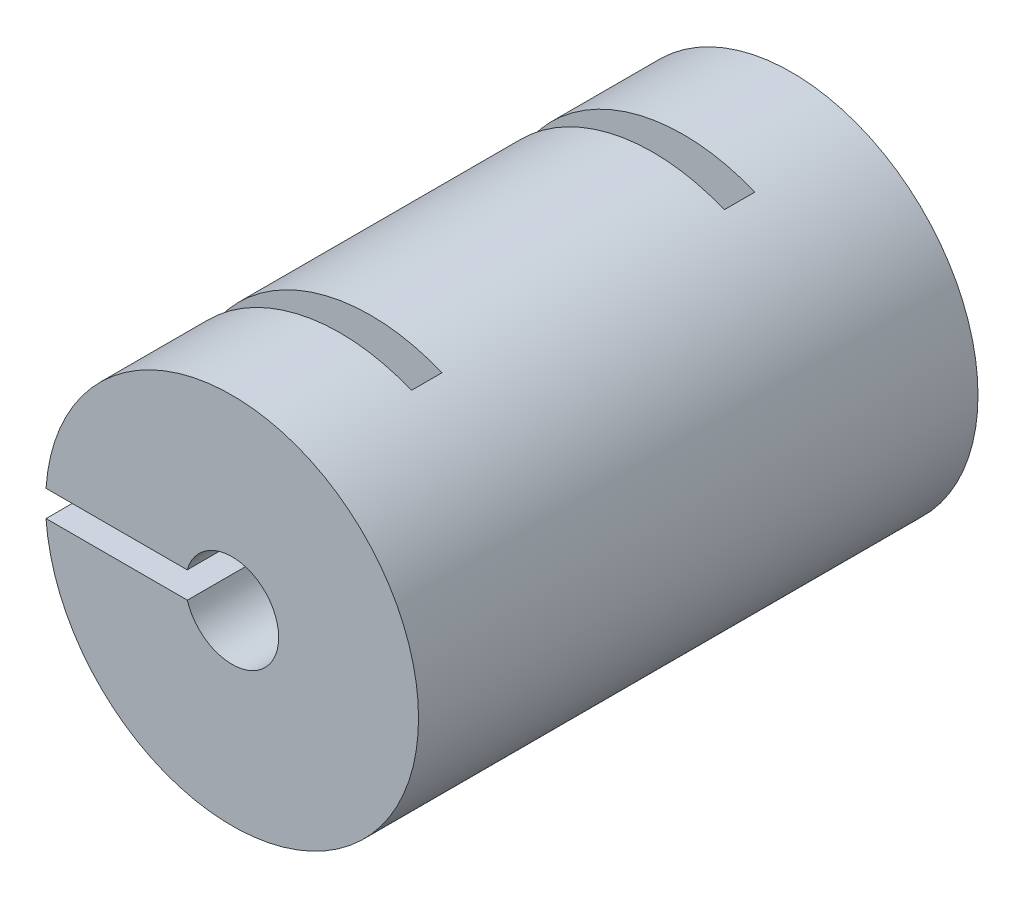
ISO-10303-21;
HEADER;
FILE_DESCRIPTION(('STEP AP214'),'2;1');
FILE_NAME('part.step','',(''),(''),'','','');
FILE_SCHEMA(('AUTOMOTIVE_DESIGN { 1 0 10303 214 1 1 1 1 }'));
ENDSEC;
DATA;
#1=APPLICATION_CONTEXT('core data for automotive mechanical design processes');
#2=APPLICATION_PROTOCOL_DEFINITION('international standard','automotive_design',2000,#1);
#3=PRODUCT_CONTEXT('',#1,'mechanical');
#4=PRODUCT('Part','Part','',(#3));
#5=PRODUCT_RELATED_PRODUCT_CATEGORY('part','',(#4));
#6=PRODUCT_DEFINITION_FORMATION('','',#4);
#7=PRODUCT_DEFINITION_CONTEXT('part definition',#1,'design');
#8=PRODUCT_DEFINITION('design','',#6,#7);
#9=PRODUCT_DEFINITION_SHAPE('','',#8);
#10=(LENGTH_UNIT() NAMED_UNIT(*) SI_UNIT(.MILLI.,.METRE.));
#11=(NAMED_UNIT(*) PLANE_ANGLE_UNIT() SI_UNIT($,.RADIAN.));
#12=(NAMED_UNIT(*) SI_UNIT($,.STERADIAN.) SOLID_ANGLE_UNIT());
#13=UNCERTAINTY_MEASURE_WITH_UNIT(LENGTH_MEASURE(1.E-05),#10,'distance_accuracy_value','');
#14=(GEOMETRIC_REPRESENTATION_CONTEXT(3) GLOBAL_UNCERTAINTY_ASSIGNED_CONTEXT((#13)) GLOBAL_UNIT_ASSIGNED_CONTEXT((#10,
#11,#12)) REPRESENTATION_CONTEXT('',''));
#15=CARTESIAN_POINT('',(0.,0.,0.));
#16=DIRECTION('',(0.,0.,1.));
#17=DIRECTION('',(1.,0.,0.));
#18=AXIS2_PLACEMENT_3D('',#15,#16,#17);
#19=CARTESIAN_POINT('',(0.,0.,9.525));
#20=DIRECTION('',(0.,0.,-1.));
#21=DIRECTION('',(-1.,0.,0.));
#22=AXIS2_PLACEMENT_3D('',#19,#20,#21);
#23=CYLINDRICAL_SURFACE('',#22,1.5875);
#24=DIRECTION('',(0.,0.,-1.));
#25=VECTOR('',#24,1.);
#26=CARTESIAN_POINT('',(-1.52101463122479,-0.454610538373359,9.525));
#27=LINE('',#26,#25);
#28=CARTESIAN_POINT('',(-1.52101463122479,-0.454610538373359,-9.525));
#29=VERTEX_POINT('',#28);
#30=CARTESIAN_POINT('',(-1.52101463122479,-0.454610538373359,-5.84564938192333));
#31=VERTEX_POINT('',#30);
#32=EDGE_CURVE('E214',#29,#31,#27,.F.);
#33=ORIENTED_EDGE('',*,*,#32,.T.);
#34=CARTESIAN_POINT('',(0.,0.,-5.84564938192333));
#35=DIRECTION('',(0.,0.,1.));
#36=DIRECTION('',(1.,0.,0.));
#37=AXIS2_PLACEMENT_3D('',#34,#35,#36);
#38=CIRCLE('',#37,1.5875);
#39=CARTESIAN_POINT('',(-1.52633171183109,0.436426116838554,-5.84564938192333));
#40=VERTEX_POINT('',#39);
#41=EDGE_CURVE('E192',#31,#40,#38,.T.);
#42=ORIENTED_EDGE('',*,*,#41,.T.);
#43=DIRECTION('',(0.,0.,-1.));
#44=VECTOR('',#43,1.);
#45=CARTESIAN_POINT('',(-1.52633171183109,0.436426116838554,9.525));
#46=LINE('',#45,#44);
#47=CARTESIAN_POINT('',(-1.52633171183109,0.436426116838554,-9.525));
#48=VERTEX_POINT('',#47);
#49=EDGE_CURVE('E217',#40,#48,#46,.T.);
#50=ORIENTED_EDGE('',*,*,#49,.T.);
#51=CARTESIAN_POINT('',(0.,0.,-9.525));
#52=DIRECTION('',(0.,0.,1.));
#53=DIRECTION('',(1.,0.,0.));
#54=AXIS2_PLACEMENT_3D('',#51,#52,#53);
#55=CIRCLE('',#54,1.5875);
#56=EDGE_CURVE('E265',#29,#48,#55,.T.);
#57=ORIENTED_EDGE('',*,*,#56,.F.);
#58=EDGE_LOOP('',(#33,#42,#50,#57));
#59=FACE_BOUND('',#58,.T.);
#60=ADVANCED_FACE('F29',(#59),#23,.F.);
#61=CARTESIAN_POINT('',(0.,0.,4.80687655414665));
#62=DIRECTION('',(0.,0.,-1.));
#63=DIRECTION('',(-1.,0.,0.));
#64=AXIS2_PLACEMENT_3D('',#61,#62,#63);
#65=CIRCLE('',#64,1.5875);
#66=CARTESIAN_POINT('',(-1.52633171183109,0.436426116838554,4.80687655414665));
#67=VERTEX_POINT('',#66);
#68=CARTESIAN_POINT('',(-1.52101463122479,-0.454610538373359,4.80687655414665));
#69=VERTEX_POINT('',#68);
#70=EDGE_CURVE('E232',#67,#69,#65,.T.);
#71=ORIENTED_EDGE('',*,*,#70,.F.);
#72=DIRECTION('',(0.,0.,-1.));
#73=VECTOR('',#72,1.);
#74=CARTESIAN_POINT('',(-1.52633171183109,0.436426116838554,9.525));
#75=LINE('',#74,#73);
#76=CARTESIAN_POINT('',(-1.52633171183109,0.436426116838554,4.445));
#77=VERTEX_POINT('',#76);
#78=EDGE_CURVE('E280',#77,#67,#75,.F.);
#79=ORIENTED_EDGE('',*,*,#78,.F.);
#80=CARTESIAN_POINT('',(0.,0.,4.445));
#81=DIRECTION('',(0.,0.,-1.));
#82=DIRECTION('',(-1.,0.,0.));
#83=AXIS2_PLACEMENT_3D('',#80,#81,#82);
#84=CIRCLE('',#83,1.5875);
#85=CARTESIAN_POINT('',(-1.52101463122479,-0.454610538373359,4.445));
#86=VERTEX_POINT('',#85);
#87=EDGE_CURVE('E277',#86,#77,#84,.T.);
#88=ORIENTED_EDGE('',*,*,#87,.F.);
#89=DIRECTION('',(0.,0.,-1.));
#90=VECTOR('',#89,1.);
#91=CARTESIAN_POINT('',(-1.52101463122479,-0.454610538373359,9.525));
#92=LINE('',#91,#90);
#93=EDGE_CURVE('E283',#69,#86,#92,.T.);
#94=ORIENTED_EDGE('',*,*,#93,.F.);
#95=EDGE_LOOP('',(#71,#79,#88,#94));
#96=FACE_BOUND('',#95,.T.);
#97=CARTESIAN_POINT('',(-1.52633171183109,0.436426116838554,-4.445));
#98=VERTEX_POINT('',#97);
#99=CARTESIAN_POINT('',(-1.52633171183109,0.436426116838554,-4.80687655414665));
#100=VERTEX_POINT('',#99);
#101=EDGE_CURVE('E218',#98,#100,#46,.T.);
#102=ORIENTED_EDGE('',*,*,#101,.T.);
#103=CARTESIAN_POINT('',(0.,0.,-4.80687655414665));
#104=DIRECTION('',(0.,0.,-1.));
#105=DIRECTION('',(-1.,0.,0.));
#106=AXIS2_PLACEMENT_3D('',#103,#104,#105);
#107=CIRCLE('',#106,1.5875);
#108=CARTESIAN_POINT('',(-1.52101463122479,-0.454610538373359,-4.80687655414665));
#109=VERTEX_POINT('',#108);
#110=EDGE_CURVE('E168',#100,#109,#107,.T.);
#111=ORIENTED_EDGE('',*,*,#110,.T.);
#112=CARTESIAN_POINT('',(-1.52101463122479,-0.454610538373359,-4.445));
#113=VERTEX_POINT('',#112);
#114=EDGE_CURVE('E213',#109,#113,#27,.F.);
#115=ORIENTED_EDGE('',*,*,#114,.T.);
#116=CARTESIAN_POINT('',(0.,0.,-4.445));
#117=DIRECTION('',(0.,0.,1.));
#118=DIRECTION('',(1.,0.,0.));
#119=AXIS2_PLACEMENT_3D('',#116,#117,#118);
#120=CIRCLE('',#119,1.5875);
#121=EDGE_CURVE('E210',#98,#113,#120,.T.);
#122=ORIENTED_EDGE('',*,*,#121,.F.);
#123=EDGE_LOOP('',(#102,#111,#115,#122));
#124=FACE_BOUND('',#123,.T.);
#125=ADVANCED_FACE('F335',(#96,#124),#23,.F.);
#126=CARTESIAN_POINT('',(0.,0.,9.525));
#127=DIRECTION('',(0.,0.,-1.));
#128=DIRECTION('',(-1.,0.,0.));
#129=AXIS2_PLACEMENT_3D('',#126,#127,#128);
#130=CYLINDRICAL_SURFACE('',#129,6.35);
#131=CARTESIAN_POINT('',(0.,0.,4.80687655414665));
#132=DIRECTION('',(0.,0.,-1.));
#133=DIRECTION('',(-1.,0.,0.));
#134=AXIS2_PLACEMENT_3D('',#131,#132,#133);
#135=CIRCLE('',#134,6.35);
#136=CARTESIAN_POINT('',(-6.33498478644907,0.436426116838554,4.80687655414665));
#137=VERTEX_POINT('',#136);
#138=CARTESIAN_POINT('',(2.42900531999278,5.86706341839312,4.80687655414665));
#139=VERTEX_POINT('',#138);
#140=EDGE_CURVE('E237',#137,#139,#135,.T.);
#141=ORIENTED_EDGE('',*,*,#140,.T.);
#142=DIRECTION('',(0.,0.,-1.));
#143=VECTOR('',#142,1.);
#144=CARTESIAN_POINT('',(2.42900531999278,5.86706341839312,9.525));
#145=LINE('',#144,#143);
#146=CARTESIAN_POINT('',(2.42900531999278,5.86706341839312,5.84564938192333));
#147=VERTEX_POINT('',#146);
#148=EDGE_CURVE('E296',#139,#147,#145,.F.);
#149=ORIENTED_EDGE('',*,*,#148,.T.);
#150=CARTESIAN_POINT('',(0.,0.,5.84564938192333));
#151=DIRECTION('',(0.,0.,1.));
#152=DIRECTION('',(1.,0.,0.));
#153=AXIS2_PLACEMENT_3D('',#150,#151,#152);
#154=CIRCLE('',#153,6.35);
#155=CARTESIAN_POINT('',(-6.33498478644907,0.436426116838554,5.84564938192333));
#156=VERTEX_POINT('',#155);
#157=EDGE_CURVE('E229',#147,#156,#154,.T.);
#158=ORIENTED_EDGE('',*,*,#157,.T.);
#159=DIRECTION('',(0.,0.,-1.));
#160=VECTOR('',#159,1.);
#161=CARTESIAN_POINT('',(-6.33498478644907,0.436426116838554,9.525));
#162=LINE('',#161,#160);
#163=CARTESIAN_POINT('',(-6.33498478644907,0.436426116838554,9.525));
#164=VERTEX_POINT('',#163);
#165=EDGE_CURVE('E257',#156,#164,#162,.F.);
#166=ORIENTED_EDGE('',*,*,#165,.T.);
#167=CARTESIAN_POINT('',(0.,0.,9.525));
#168=DIRECTION('',(0.,0.,1.));
#169=DIRECTION('',(1.,0.,0.));
#170=AXIS2_PLACEMENT_3D('',#167,#168,#169);
#171=CIRCLE('',#170,6.35);
#172=CARTESIAN_POINT('',(-6.33370580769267,-0.454610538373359,9.525));
#173=VERTEX_POINT('',#172);
#174=EDGE_CURVE('E274',#173,#164,#171,.T.);
#175=ORIENTED_EDGE('',*,*,#174,.F.);
#176=DIRECTION('',(0.,0.,-1.));
#177=VECTOR('',#176,1.);
#178=CARTESIAN_POINT('',(-6.33370580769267,-0.454610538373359,9.525));
#179=LINE('',#178,#177);
#180=CARTESIAN_POINT('',(-6.33370580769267,-0.454610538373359,5.84564938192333));
#181=VERTEX_POINT('',#180);
#182=EDGE_CURVE('E262',#173,#181,#179,.T.);
#183=ORIENTED_EDGE('',*,*,#182,.T.);
#184=CARTESIAN_POINT('',(2.42900531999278,-5.86706341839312,5.84564938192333));
#185=VERTEX_POINT('',#184);
#186=EDGE_CURVE('E230',#181,#185,#154,.T.);
#187=ORIENTED_EDGE('',*,*,#186,.T.);
#188=DIRECTION('',(0.,0.,-1.));
#189=VECTOR('',#188,1.);
#190=CARTESIAN_POINT('',(2.42900531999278,-5.86706341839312,9.525));
#191=LINE('',#190,#189);
#192=CARTESIAN_POINT('',(2.42900531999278,-5.86706341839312,4.80687655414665));
#193=VERTEX_POINT('',#192);
#194=EDGE_CURVE('E293',#185,#193,#191,.T.);
#195=ORIENTED_EDGE('',*,*,#194,.T.);
#196=CARTESIAN_POINT('',(-6.33370580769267,-0.454610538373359,4.80687655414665));
#197=VERTEX_POINT('',#196);
#198=EDGE_CURVE('E240',#193,#197,#135,.T.);
#199=ORIENTED_EDGE('',*,*,#198,.T.);
#200=CARTESIAN_POINT('',(-6.33370580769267,-0.454610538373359,4.445));
#201=VERTEX_POINT('',#200);
#202=EDGE_CURVE('E261',#197,#201,#179,.T.);
#203=ORIENTED_EDGE('',*,*,#202,.T.);
#204=CARTESIAN_POINT('',(0.,0.,4.445));
#205=DIRECTION('',(0.,0.,-1.));
#206=DIRECTION('',(-1.,0.,0.));
#207=AXIS2_PLACEMENT_3D('',#204,#205,#206);
#208=CIRCLE('',#207,6.35);
#209=CARTESIAN_POINT('',(-6.33498478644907,0.436426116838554,4.445));
#210=VERTEX_POINT('',#209);
#211=EDGE_CURVE('E254',#201,#210,#208,.T.);
#212=ORIENTED_EDGE('',*,*,#211,.T.);
#213=EDGE_CURVE('E258',#210,#137,#162,.F.);
#214=ORIENTED_EDGE('',*,*,#213,.T.);
#215=EDGE_LOOP('',(#141,#149,#158,#166,#175,#183,#187,#195,#199,#203,#212,#214));
#216=FACE_BOUND('',#215,.T.);
#217=CARTESIAN_POINT('',(0.,0.,-5.84564938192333));
#218=DIRECTION('',(0.,0.,1.));
#219=DIRECTION('',(1.,0.,0.));
#220=AXIS2_PLACEMENT_3D('',#217,#218,#219);
#221=CIRCLE('',#220,6.35);
#222=CARTESIAN_POINT('',(-6.33370580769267,-0.454610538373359,-5.84564938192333));
#223=VERTEX_POINT('',#222);
#224=CARTESIAN_POINT('',(2.42900531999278,-5.86706341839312,-5.84564938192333));
#225=VERTEX_POINT('',#224);
#226=EDGE_CURVE('E190',#223,#225,#221,.T.);
#227=ORIENTED_EDGE('',*,*,#226,.F.);
#228=DIRECTION('',(0.,0.,-1.));
#229=VECTOR('',#228,1.);
#230=CARTESIAN_POINT('',(-6.33370580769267,-0.454610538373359,9.525));
#231=LINE('',#230,#229);
#232=CARTESIAN_POINT('',(-6.33370580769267,-0.454610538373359,-9.525));
#233=VERTEX_POINT('',#232);
#234=EDGE_CURVE('E301',#233,#223,#231,.F.);
#235=ORIENTED_EDGE('',*,*,#234,.F.);
#236=CARTESIAN_POINT('',(0.,0.,-9.525));
#237=DIRECTION('',(0.,0.,1.));
#238=DIRECTION('',(1.,0.,0.));
#239=AXIS2_PLACEMENT_3D('',#236,#237,#238);
#240=CIRCLE('',#239,6.35);
#241=CARTESIAN_POINT('',(-6.33498478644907,0.436426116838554,-9.525));
#242=VERTEX_POINT('',#241);
#243=EDGE_CURVE('E271',#233,#242,#240,.T.);
#244=ORIENTED_EDGE('',*,*,#243,.T.);
#245=DIRECTION('',(0.,0.,-1.));
#246=VECTOR('',#245,1.);
#247=CARTESIAN_POINT('',(-6.33498478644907,0.436426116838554,9.525));
#248=LINE('',#247,#246);
#249=CARTESIAN_POINT('',(-6.33498478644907,0.436426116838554,-5.84564938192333));
#250=VERTEX_POINT('',#249);
#251=EDGE_CURVE('E304',#250,#242,#248,.T.);
#252=ORIENTED_EDGE('',*,*,#251,.F.);
#253=CARTESIAN_POINT('',(2.42900531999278,5.86706341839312,-5.84564938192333));
#254=VERTEX_POINT('',#253);
#255=EDGE_CURVE('E193',#254,#250,#221,.T.);
#256=ORIENTED_EDGE('',*,*,#255,.F.);
#257=DIRECTION('',(0.,0.,-1.));
#258=VECTOR('',#257,1.);
#259=CARTESIAN_POINT('',(2.42900531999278,5.86706341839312,9.525));
#260=LINE('',#259,#258);
#261=CARTESIAN_POINT('',(2.42900531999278,5.86706341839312,-4.80687655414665));
#262=VERTEX_POINT('',#261);
#263=EDGE_CURVE('E11',#262,#254,#260,.T.);
#264=ORIENTED_EDGE('',*,*,#263,.F.);
#265=CARTESIAN_POINT('',(0.,0.,-4.80687655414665));
#266=DIRECTION('',(0.,0.,-1.));
#267=DIRECTION('',(-1.,0.,0.));
#268=AXIS2_PLACEMENT_3D('',#265,#266,#267);
#269=CIRCLE('',#268,6.35);
#270=CARTESIAN_POINT('',(-6.33498478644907,0.436426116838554,-4.80687655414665));
#271=VERTEX_POINT('',#270);
#272=EDGE_CURVE('E171',#271,#262,#269,.T.);
#273=ORIENTED_EDGE('',*,*,#272,.F.);
#274=CARTESIAN_POINT('',(-6.33498478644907,0.436426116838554,-4.445));
#275=VERTEX_POINT('',#274);
#276=EDGE_CURVE('E305',#275,#271,#248,.T.);
#277=ORIENTED_EDGE('',*,*,#276,.F.);
#278=CARTESIAN_POINT('',(0.,0.,-4.445));
#279=DIRECTION('',(0.,0.,1.));
#280=DIRECTION('',(1.,0.,0.));
#281=AXIS2_PLACEMENT_3D('',#278,#279,#280);
#282=CIRCLE('',#281,6.35);
#283=CARTESIAN_POINT('',(-6.33370580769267,-0.454610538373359,-4.445));
#284=VERTEX_POINT('',#283);
#285=EDGE_CURVE('E299',#275,#284,#282,.T.);
#286=ORIENTED_EDGE('',*,*,#285,.T.);
#287=CARTESIAN_POINT('',(-6.33370580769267,-0.454610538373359,-4.80687655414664));
#288=VERTEX_POINT('',#287);
#289=EDGE_CURVE('E51',#288,#284,#231,.F.);
#290=ORIENTED_EDGE('',*,*,#289,.F.);
#291=CARTESIAN_POINT('',(2.42900531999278,-5.86706341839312,-4.80687655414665));
#292=VERTEX_POINT('',#291);
#293=EDGE_CURVE('E44',#292,#288,#269,.T.);
#294=ORIENTED_EDGE('',*,*,#293,.F.);
#295=DIRECTION('',(0.,0.,-1.));
#296=VECTOR('',#295,1.);
#297=CARTESIAN_POINT('',(2.42900531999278,-5.86706341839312,9.525));
#298=LINE('',#297,#296);
#299=EDGE_CURVE('E37',#225,#292,#298,.F.);
#300=ORIENTED_EDGE('',*,*,#299,.F.);
#301=EDGE_LOOP('',(#227,#235,#244,#252,#256,#264,#273,#277,#286,#290,#294,#300));
#302=FACE_BOUND('',#301,.T.);
#303=ADVANCED_FACE('F31',(#216,#302),#130,.T.);
#304=CARTESIAN_POINT('',(0.263674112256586,0.436426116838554,-4.445));
#305=DIRECTION('',(0.,-1.,0.));
#306=DIRECTION('',(0.,0.,-1.));
#307=AXIS2_PLACEMENT_3D('',#304,#305,#306);
#308=PLANE('',#307);
#309=ORIENTED_EDGE('',*,*,#49,.F.);
#310=DIRECTION('',(-1.,0.,0.));
#311=VECTOR('',#310,1.);
#312=CARTESIAN_POINT('',(0.263674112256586,0.436426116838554,-5.84564938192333));
#313=LINE('',#312,#311);
#314=EDGE_CURVE('E196',#40,#250,#313,.T.);
#315=ORIENTED_EDGE('',*,*,#314,.T.);
#316=ORIENTED_EDGE('',*,*,#251,.T.);
#317=DIRECTION('',(-1.,0.,0.));
#318=VECTOR('',#317,1.);
#319=CARTESIAN_POINT('',(0.263674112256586,0.436426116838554,-9.525));
#320=LINE('',#319,#318);
#321=EDGE_CURVE('E202',#48,#242,#320,.T.);
#322=ORIENTED_EDGE('',*,*,#321,.F.);
#323=EDGE_LOOP('',(#309,#315,#316,#322));
#324=FACE_BOUND('',#323,.T.);
#325=ADVANCED_FACE('F326',(#324),#308,.T.);
#326=ORIENTED_EDGE('',*,*,#276,.T.);
#327=DIRECTION('',(1.,0.,0.));
#328=VECTOR('',#327,1.);
#329=CARTESIAN_POINT('',(0.263674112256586,0.436426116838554,-4.80687655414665));
#330=LINE('',#329,#328);
#331=EDGE_CURVE('E187',#271,#100,#330,.T.);
#332=ORIENTED_EDGE('',*,*,#331,.T.);
#333=ORIENTED_EDGE('',*,*,#101,.F.);
#334=DIRECTION('',(-1.,0.,0.));
#335=VECTOR('',#334,1.);
#336=CARTESIAN_POINT('',(0.263674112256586,0.436426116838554,-4.445));
#337=LINE('',#336,#335);
#338=EDGE_CURVE('E207',#98,#275,#337,.T.);
#339=ORIENTED_EDGE('',*,*,#338,.T.);
#340=EDGE_LOOP('',(#326,#332,#333,#339));
#341=FACE_BOUND('',#340,.T.);
#342=ADVANCED_FACE('F328',(#341),#308,.T.);
#343=CARTESIAN_POINT('',(0.263674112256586,-0.454610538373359,-4.445));
#344=DIRECTION('',(0.,1.,0.));
#345=DIRECTION('',(0.,0.,1.));
#346=AXIS2_PLACEMENT_3D('',#343,#344,#345);
#347=PLANE('',#346);
#348=ORIENTED_EDGE('',*,*,#234,.T.);
#349=DIRECTION('',(1.,0.,0.));
#350=VECTOR('',#349,1.);
#351=CARTESIAN_POINT('',(0.263674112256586,-0.454610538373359,-5.84564938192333));
#352=LINE('',#351,#350);
#353=EDGE_CURVE('E179',#223,#31,#352,.T.);
#354=ORIENTED_EDGE('',*,*,#353,.T.);
#355=ORIENTED_EDGE('',*,*,#32,.F.);
#356=DIRECTION('',(1.,0.,0.));
#357=VECTOR('',#356,1.);
#358=CARTESIAN_POINT('',(0.263674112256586,-0.454610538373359,-9.525));
#359=LINE('',#358,#357);
#360=EDGE_CURVE('E199',#233,#29,#359,.T.);
#361=ORIENTED_EDGE('',*,*,#360,.F.);
#362=EDGE_LOOP('',(#348,#354,#355,#361));
#363=FACE_BOUND('',#362,.T.);
#364=ADVANCED_FACE('F312',(#363),#347,.T.);
#365=ORIENTED_EDGE('',*,*,#114,.F.);
#366=DIRECTION('',(-1.,0.,0.));
#367=VECTOR('',#366,1.);
#368=CARTESIAN_POINT('',(0.263674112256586,-0.454610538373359,-4.80687655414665));
#369=LINE('',#368,#367);
#370=EDGE_CURVE('E308',#109,#288,#369,.T.);
#371=ORIENTED_EDGE('',*,*,#370,.T.);
#372=ORIENTED_EDGE('',*,*,#289,.T.);
#373=DIRECTION('',(1.,0.,0.));
#374=VECTOR('',#373,1.);
#375=CARTESIAN_POINT('',(0.263674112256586,-0.454610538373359,-4.445));
#376=LINE('',#375,#374);
#377=EDGE_CURVE('E205',#284,#113,#376,.T.);
#378=ORIENTED_EDGE('',*,*,#377,.T.);
#379=EDGE_LOOP('',(#365,#371,#372,#378));
#380=FACE_BOUND('',#379,.T.);
#381=ADVANCED_FACE('F411',(#380),#347,.T.);
#382=CARTESIAN_POINT('',(0.,0.,-9.525));
#383=DIRECTION('',(0.,0.,1.));
#384=DIRECTION('',(1.,0.,0.));
#385=AXIS2_PLACEMENT_3D('',#382,#383,#384);
#386=PLANE('',#385);
#387=ORIENTED_EDGE('',*,*,#321,.T.);
#388=ORIENTED_EDGE('',*,*,#243,.F.);
#389=ORIENTED_EDGE('',*,*,#360,.T.);
#390=ORIENTED_EDGE('',*,*,#56,.T.);
#391=EDGE_LOOP('',(#387,#388,#389,#390));
#392=FACE_BOUND('',#391,.T.);
#393=ADVANCED_FACE('F320',(#392),#386,.F.);
#394=CARTESIAN_POINT('',(0.263674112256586,-0.454610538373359,4.445));
#395=DIRECTION('',(0.,-1.,0.));
#396=DIRECTION('',(0.,0.,-1.));
#397=AXIS2_PLACEMENT_3D('',#394,#395,#396);
#398=PLANE('',#397);
#399=ORIENTED_EDGE('',*,*,#202,.F.);
#400=DIRECTION('',(1.,0.,0.));
#401=VECTOR('',#400,1.);
#402=CARTESIAN_POINT('',(0.263674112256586,-0.454610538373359,4.80687655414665));
#403=LINE('',#402,#401);
#404=EDGE_CURVE('E239',#197,#69,#403,.T.);
#405=ORIENTED_EDGE('',*,*,#404,.T.);
#406=ORIENTED_EDGE('',*,*,#93,.T.);
#407=DIRECTION('',(1.,0.,0.));
#408=VECTOR('',#407,1.);
#409=CARTESIAN_POINT('',(0.263674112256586,-0.454610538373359,4.445));
#410=LINE('',#409,#408);
#411=EDGE_CURVE('E251',#201,#86,#410,.T.);
#412=ORIENTED_EDGE('',*,*,#411,.F.);
#413=EDGE_LOOP('',(#399,#405,#406,#412));
#414=FACE_BOUND('',#413,.T.);
#415=ADVANCED_FACE('F360',(#414),#398,.F.);
#416=CARTESIAN_POINT('',(0.263674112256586,0.436426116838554,4.445));
#417=DIRECTION('',(0.,1.,0.));
#418=DIRECTION('',(0.,0.,1.));
#419=AXIS2_PLACEMENT_3D('',#416,#417,#418);
#420=PLANE('',#419);
#421=ORIENTED_EDGE('',*,*,#78,.T.);
#422=DIRECTION('',(-1.,0.,0.));
#423=VECTOR('',#422,1.);
#424=CARTESIAN_POINT('',(0.263674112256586,0.436426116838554,4.80687655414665));
#425=LINE('',#424,#423);
#426=EDGE_CURVE('E290',#67,#137,#425,.T.);
#427=ORIENTED_EDGE('',*,*,#426,.T.);
#428=ORIENTED_EDGE('',*,*,#213,.F.);
#429=DIRECTION('',(-1.,0.,0.));
#430=VECTOR('',#429,1.);
#431=CARTESIAN_POINT('',(0.263674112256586,0.436426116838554,4.445));
#432=LINE('',#431,#430);
#433=EDGE_CURVE('E248',#77,#210,#432,.T.);
#434=ORIENTED_EDGE('',*,*,#433,.F.);
#435=EDGE_LOOP('',(#421,#427,#428,#434));
#436=FACE_BOUND('',#435,.T.);
#437=ADVANCED_FACE('F362',(#436),#420,.F.);
#438=CARTESIAN_POINT('',(0.,0.,9.525));
#439=DIRECTION('',(0.,0.,1.));
#440=DIRECTION('',(1.,0.,0.));
#441=AXIS2_PLACEMENT_3D('',#438,#439,#440);
#442=PLANE('',#441);
#443=DIRECTION('',(1.,0.,0.));
#444=VECTOR('',#443,1.);
#445=CARTESIAN_POINT('',(0.263674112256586,-0.454610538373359,9.525));
#446=LINE('',#445,#444);
#447=CARTESIAN_POINT('',(-1.52101463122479,-0.454610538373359,9.525));
#448=VERTEX_POINT('',#447);
#449=EDGE_CURVE('E246',#173,#448,#446,.T.);
#450=ORIENTED_EDGE('',*,*,#449,.F.);
#451=ORIENTED_EDGE('',*,*,#174,.T.);
#452=DIRECTION('',(-1.,0.,0.));
#453=VECTOR('',#452,1.);
#454=CARTESIAN_POINT('',(0.263674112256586,0.436426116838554,9.525));
#455=LINE('',#454,#453);
#456=CARTESIAN_POINT('',(-1.52633171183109,0.436426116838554,9.525));
#457=VERTEX_POINT('',#456);
#458=EDGE_CURVE('E243',#457,#164,#455,.T.);
#459=ORIENTED_EDGE('',*,*,#458,.F.);
#460=CARTESIAN_POINT('',(0.,0.,9.525));
#461=DIRECTION('',(0.,0.,1.));
#462=DIRECTION('',(1.,0.,0.));
#463=AXIS2_PLACEMENT_3D('',#460,#461,#462);
#464=CIRCLE('',#463,1.5875);
#465=EDGE_CURVE('E268',#448,#457,#464,.T.);
#466=ORIENTED_EDGE('',*,*,#465,.F.);
#467=EDGE_LOOP('',(#450,#451,#459,#466));
#468=FACE_BOUND('',#467,.T.);
#469=ADVANCED_FACE('F351',(#468),#442,.T.);
#470=CARTESIAN_POINT('',(0.,0.,5.84564938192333));
#471=DIRECTION('',(0.,0.,1.));
#472=DIRECTION('',(1.,0.,0.));
#473=AXIS2_PLACEMENT_3D('',#470,#471,#472);
#474=CIRCLE('',#473,1.5875);
#475=CARTESIAN_POINT('',(-1.52101463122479,-0.454610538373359,5.84564938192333));
#476=VERTEX_POINT('',#475);
#477=CARTESIAN_POINT('',(-1.52633171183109,0.436426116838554,5.84564938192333));
#478=VERTEX_POINT('',#477);
#479=EDGE_CURVE('E225',#476,#478,#474,.T.);
#480=ORIENTED_EDGE('',*,*,#479,.F.);
#481=EDGE_CURVE('E284',#448,#476,#92,.T.);
#482=ORIENTED_EDGE('',*,*,#481,.F.);
#483=ORIENTED_EDGE('',*,*,#465,.T.);
#484=EDGE_CURVE('E279',#478,#457,#75,.F.);
#485=ORIENTED_EDGE('',*,*,#484,.F.);
#486=EDGE_LOOP('',(#480,#482,#483,#485));
#487=FACE_BOUND('',#486,.T.);
#488=ADVANCED_FACE('F341',(#487),#23,.F.);
#489=ORIENTED_EDGE('',*,*,#481,.T.);
#490=DIRECTION('',(-1.,0.,0.));
#491=VECTOR('',#490,1.);
#492=CARTESIAN_POINT('',(0.263674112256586,-0.454610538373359,5.84564938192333));
#493=LINE('',#492,#491);
#494=EDGE_CURVE('E233',#476,#181,#493,.T.);
#495=ORIENTED_EDGE('',*,*,#494,.T.);
#496=ORIENTED_EDGE('',*,*,#182,.F.);
#497=ORIENTED_EDGE('',*,*,#449,.T.);
#498=EDGE_LOOP('',(#489,#495,#496,#497));
#499=FACE_BOUND('',#498,.T.);
#500=ADVANCED_FACE('F350',(#499),#398,.F.);
#501=ORIENTED_EDGE('',*,*,#165,.F.);
#502=DIRECTION('',(1.,0.,0.));
#503=VECTOR('',#502,1.);
#504=CARTESIAN_POINT('',(0.263674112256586,0.436426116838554,5.84564938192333));
#505=LINE('',#504,#503);
#506=EDGE_CURVE('E287',#156,#478,#505,.T.);
#507=ORIENTED_EDGE('',*,*,#506,.T.);
#508=ORIENTED_EDGE('',*,*,#484,.T.);
#509=ORIENTED_EDGE('',*,*,#458,.T.);
#510=EDGE_LOOP('',(#501,#507,#508,#509));
#511=FACE_BOUND('',#510,.T.);
#512=ADVANCED_FACE('F357',(#511),#420,.F.);
#513=CARTESIAN_POINT('',(0.263674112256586,-0.454610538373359,4.445));
#514=DIRECTION('',(0.,0.,-1.));
#515=DIRECTION('',(-1.,0.,0.));
#516=AXIS2_PLACEMENT_3D('',#513,#514,#515);
#517=PLANE('',#516);
#518=ORIENTED_EDGE('',*,*,#411,.T.);
#519=ORIENTED_EDGE('',*,*,#87,.T.);
#520=ORIENTED_EDGE('',*,*,#433,.T.);
#521=ORIENTED_EDGE('',*,*,#211,.F.);
#522=EDGE_LOOP('',(#518,#519,#520,#521));
#523=FACE_BOUND('',#522,.T.);
#524=ADVANCED_FACE('F397',(#523),#517,.F.);
#525=CARTESIAN_POINT('',(2.42900531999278,-6.35,4.80687655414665));
#526=DIRECTION('',(1.,0.,0.));
#527=DIRECTION('',(0.,0.,-1.));
#528=AXIS2_PLACEMENT_3D('',#525,#526,#527);
#529=PLANE('',#528);
#530=DIRECTION('',(0.,1.,0.));
#531=VECTOR('',#530,1.);
#532=CARTESIAN_POINT('',(2.42900531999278,-6.35,5.84564938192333));
#533=LINE('',#532,#531);
#534=EDGE_CURVE('E221',#185,#147,#533,.T.);
#535=ORIENTED_EDGE('',*,*,#534,.T.);
#536=ORIENTED_EDGE('',*,*,#148,.F.);
#537=DIRECTION('',(0.,1.,0.));
#538=VECTOR('',#537,1.);
#539=CARTESIAN_POINT('',(2.42900531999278,-6.35,4.80687655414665));
#540=LINE('',#539,#538);
#541=EDGE_CURVE('E222',#193,#139,#540,.T.);
#542=ORIENTED_EDGE('',*,*,#541,.F.);
#543=ORIENTED_EDGE('',*,*,#194,.F.);
#544=EDGE_LOOP('',(#535,#536,#542,#543));
#545=FACE_BOUND('',#544,.T.);
#546=ADVANCED_FACE('F380',(#545),#529,.F.);
#547=CARTESIAN_POINT('',(-11.0750414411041,-6.35,4.80687655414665));
#548=DIRECTION('',(0.,0.,-1.));
#549=DIRECTION('',(-1.,0.,0.));
#550=AXIS2_PLACEMENT_3D('',#547,#548,#549);
#551=PLANE('',#550);
#552=ORIENTED_EDGE('',*,*,#541,.T.);
#553=ORIENTED_EDGE('',*,*,#140,.F.);
#554=ORIENTED_EDGE('',*,*,#426,.F.);
#555=ORIENTED_EDGE('',*,*,#70,.T.);
#556=ORIENTED_EDGE('',*,*,#404,.F.);
#557=ORIENTED_EDGE('',*,*,#198,.F.);
#558=EDGE_LOOP('',(#552,#553,#554,#555,#556,#557));
#559=FACE_BOUND('',#558,.T.);
#560=ADVANCED_FACE('F383',(#559),#551,.F.);
#561=CARTESIAN_POINT('',(-11.0750414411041,-6.35,5.84564938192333));
#562=DIRECTION('',(0.,0.,1.));
#563=DIRECTION('',(1.,0.,0.));
#564=AXIS2_PLACEMENT_3D('',#561,#562,#563);
#565=PLANE('',#564);
#566=ORIENTED_EDGE('',*,*,#186,.F.);
#567=ORIENTED_EDGE('',*,*,#494,.F.);
#568=ORIENTED_EDGE('',*,*,#479,.T.);
#569=ORIENTED_EDGE('',*,*,#506,.F.);
#570=ORIENTED_EDGE('',*,*,#157,.F.);
#571=ORIENTED_EDGE('',*,*,#534,.F.);
#572=EDGE_LOOP('',(#566,#567,#568,#569,#570,#571));
#573=FACE_BOUND('',#572,.T.);
#574=ADVANCED_FACE('F375',(#573),#565,.F.);
#575=CARTESIAN_POINT('',(0.263674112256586,-0.454610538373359,-4.445));
#576=DIRECTION('',(0.,0.,1.));
#577=DIRECTION('',(-1.,0.,0.));
#578=AXIS2_PLACEMENT_3D('',#575,#576,#577);
#579=PLANE('',#578);
#580=ORIENTED_EDGE('',*,*,#121,.T.);
#581=ORIENTED_EDGE('',*,*,#377,.F.);
#582=ORIENTED_EDGE('',*,*,#285,.F.);
#583=ORIENTED_EDGE('',*,*,#338,.F.);
#584=EDGE_LOOP('',(#580,#581,#582,#583));
#585=FACE_BOUND('',#584,.T.);
#586=ADVANCED_FACE('F407',(#585),#579,.F.);
#587=CARTESIAN_POINT('',(2.42900531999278,-6.35,-4.80687655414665));
#588=DIRECTION('',(-1.,0.,0.));
#589=DIRECTION('',(0.,0.,1.));
#590=AXIS2_PLACEMENT_3D('',#587,#588,#589);
#591=PLANE('',#590);
#592=ORIENTED_EDGE('',*,*,#263,.T.);
#593=DIRECTION('',(0.,1.,0.));
#594=VECTOR('',#593,1.);
#595=CARTESIAN_POINT('',(2.42900531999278,-6.35,-5.84564938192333));
#596=LINE('',#595,#594);
#597=EDGE_CURVE('E169',#225,#254,#596,.T.);
#598=ORIENTED_EDGE('',*,*,#597,.F.);
#599=ORIENTED_EDGE('',*,*,#299,.T.);
#600=DIRECTION('',(0.,1.,0.));
#601=VECTOR('',#600,1.);
#602=CARTESIAN_POINT('',(2.42900531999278,-6.35,-4.80687655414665));
#603=LINE('',#602,#601);
#604=EDGE_CURVE('E176',#292,#262,#603,.T.);
#605=ORIENTED_EDGE('',*,*,#604,.T.);
#606=EDGE_LOOP('',(#592,#598,#599,#605));
#607=FACE_BOUND('',#606,.T.);
#608=ADVANCED_FACE('F175',(#607),#591,.T.);
#609=CARTESIAN_POINT('',(-11.0750414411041,-6.35,-5.84564938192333));
#610=DIRECTION('',(0.,0.,1.));
#611=DIRECTION('',(1.,0.,0.));
#612=AXIS2_PLACEMENT_3D('',#609,#610,#611);
#613=PLANE('',#612);
#614=ORIENTED_EDGE('',*,*,#255,.T.);
#615=ORIENTED_EDGE('',*,*,#314,.F.);
#616=ORIENTED_EDGE('',*,*,#41,.F.);
#617=ORIENTED_EDGE('',*,*,#353,.F.);
#618=ORIENTED_EDGE('',*,*,#226,.T.);
#619=ORIENTED_EDGE('',*,*,#597,.T.);
#620=EDGE_LOOP('',(#614,#615,#616,#617,#618,#619));
#621=FACE_BOUND('',#620,.T.);
#622=ADVANCED_FACE('F323',(#621),#613,.T.);
#623=CARTESIAN_POINT('',(-11.0750414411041,-6.35,-4.80687655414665));
#624=DIRECTION('',(0.,0.,-1.));
#625=DIRECTION('',(-1.,0.,0.));
#626=AXIS2_PLACEMENT_3D('',#623,#624,#625);
#627=PLANE('',#626);
#628=ORIENTED_EDGE('',*,*,#272,.T.);
#629=ORIENTED_EDGE('',*,*,#604,.F.);
#630=ORIENTED_EDGE('',*,*,#293,.T.);
#631=ORIENTED_EDGE('',*,*,#370,.F.);
#632=ORIENTED_EDGE('',*,*,#110,.F.);
#633=ORIENTED_EDGE('',*,*,#331,.F.);
#634=EDGE_LOOP('',(#628,#629,#630,#631,#632,#633));
#635=FACE_BOUND('',#634,.T.);
#636=ADVANCED_FACE('F180',(#635),#627,.T.);
#637=CLOSED_SHELL('',(#60,#125,#303,#325,#342,#364,#381,#393,#415,#437,#469,#488,#500,#512,#524,
#546,#560,#574,#586,#608,#622,#636));
#638=MANIFOLD_SOLID_BREP('B2',#637);
#639=ADVANCED_BREP_SHAPE_REPRESENTATION('',(#18,#638),#14);
#640=SHAPE_DEFINITION_REPRESENTATION(#9,#639);
ENDSEC;
END-ISO-10303-21;
